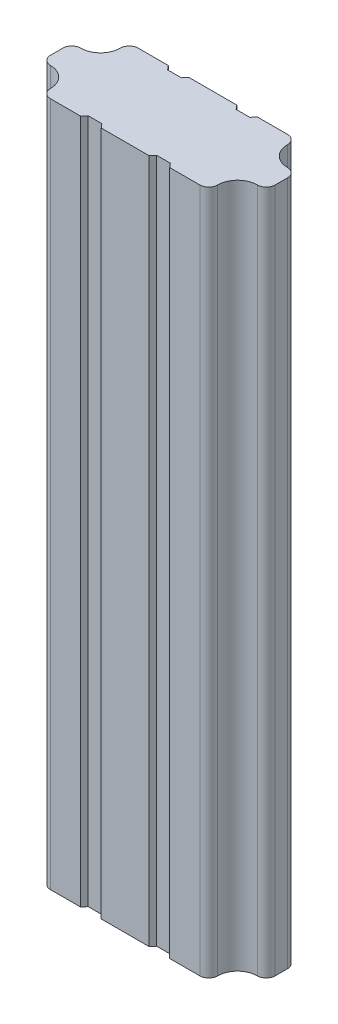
ISO-10303-21;
HEADER;
FILE_DESCRIPTION(('STEP AP214'),'2;1');
FILE_NAME('part.step','',(''),(''),'','','');
FILE_SCHEMA(('AUTOMOTIVE_DESIGN { 1 0 10303 214 1 1 1 1 }'));
ENDSEC;
DATA;
#1=APPLICATION_CONTEXT('core data for automotive mechanical design processes');
#2=APPLICATION_PROTOCOL_DEFINITION('international standard','automotive_design',2000,#1);
#3=PRODUCT_CONTEXT('',#1,'mechanical');
#4=PRODUCT('Part','Part','',(#3));
#5=PRODUCT_RELATED_PRODUCT_CATEGORY('part','',(#4));
#6=PRODUCT_DEFINITION_FORMATION('','',#4);
#7=PRODUCT_DEFINITION_CONTEXT('part definition',#1,'design');
#8=PRODUCT_DEFINITION('design','',#6,#7);
#9=PRODUCT_DEFINITION_SHAPE('','',#8);
#10=(LENGTH_UNIT() NAMED_UNIT(*) SI_UNIT(.MILLI.,.METRE.));
#11=(NAMED_UNIT(*) PLANE_ANGLE_UNIT() SI_UNIT($,.RADIAN.));
#12=(NAMED_UNIT(*) SI_UNIT($,.STERADIAN.) SOLID_ANGLE_UNIT());
#13=UNCERTAINTY_MEASURE_WITH_UNIT(LENGTH_MEASURE(1.E-05),#10,'distance_accuracy_value','');
#14=(GEOMETRIC_REPRESENTATION_CONTEXT(3) GLOBAL_UNCERTAINTY_ASSIGNED_CONTEXT((#13)) GLOBAL_UNIT_ASSIGNED_CONTEXT((#10,
#11,#12)) REPRESENTATION_CONTEXT('',''));
#15=CARTESIAN_POINT('',(0.,0.,0.));
#16=DIRECTION('',(0.,0.,1.));
#17=DIRECTION('',(1.,0.,0.));
#18=AXIS2_PLACEMENT_3D('',#15,#16,#17);
#19=CARTESIAN_POINT('',(-54.5,500.,-25.5));
#20=DIRECTION('',(0.,-1.,0.));
#21=DIRECTION('',(0.,0.,-1.));
#22=AXIS2_PLACEMENT_3D('',#19,#20,#21);
#23=CYLINDRICAL_SURFACE('',#22,6.5);
#24=CARTESIAN_POINT('',(-54.5,0.,-25.5));
#25=DIRECTION('',(0.,1.,0.));
#26=DIRECTION('',(0.,0.,1.));
#27=AXIS2_PLACEMENT_3D('',#24,#25,#26);
#28=CIRCLE('',#27,6.5);
#29=CARTESIAN_POINT('',(-61.,0.,-25.5));
#30=VERTEX_POINT('',#29);
#31=CARTESIAN_POINT('',(-54.5,0.,-32.));
#32=VERTEX_POINT('',#31);
#33=EDGE_CURVE('E281',#30,#32,#28,.F.);
#34=ORIENTED_EDGE('',*,*,#33,.F.);
#35=DIRECTION('',(0.,-1.,0.));
#36=VECTOR('',#35,1.);
#37=CARTESIAN_POINT('',(-61.,500.,-25.5));
#38=LINE('',#37,#36);
#39=CARTESIAN_POINT('',(-61.,500.,-25.5));
#40=VERTEX_POINT('',#39);
#41=EDGE_CURVE('E11',#40,#30,#38,.T.);
#42=ORIENTED_EDGE('',*,*,#41,.F.);
#43=CARTESIAN_POINT('',(-54.5,500.,-25.5));
#44=DIRECTION('',(0.,1.,0.));
#45=DIRECTION('',(0.,0.,1.));
#46=AXIS2_PLACEMENT_3D('',#43,#44,#45);
#47=CIRCLE('',#46,6.5);
#48=CARTESIAN_POINT('',(-54.5,500.,-32.));
#49=VERTEX_POINT('',#48);
#50=EDGE_CURVE('E400',#40,#49,#47,.F.);
#51=ORIENTED_EDGE('',*,*,#50,.T.);
#52=DIRECTION('',(0.,-1.,0.));
#53=VECTOR('',#52,1.);
#54=CARTESIAN_POINT('',(-54.5,500.,-32.));
#55=LINE('',#54,#53);
#56=EDGE_CURVE('E163',#49,#32,#55,.T.);
#57=ORIENTED_EDGE('',*,*,#56,.T.);
#58=EDGE_LOOP('',(#34,#42,#51,#57));
#59=FACE_BOUND('',#58,.T.);
#60=ADVANCED_FACE('F39',(#59),#23,.T.);
#61=CARTESIAN_POINT('',(-75.5,500.,-25.5));
#62=DIRECTION('',(0.,-1.,0.));
#63=DIRECTION('',(0.,0.,-1.));
#64=AXIS2_PLACEMENT_3D('',#61,#62,#63);
#65=CYLINDRICAL_SURFACE('',#64,14.5);
#66=CARTESIAN_POINT('',(-75.5,0.,-25.5));
#67=DIRECTION('',(0.,1.,0.));
#68=DIRECTION('',(0.,0.,1.));
#69=AXIS2_PLACEMENT_3D('',#66,#67,#68);
#70=CIRCLE('',#69,14.5);
#71=CARTESIAN_POINT('',(-75.5,0.,-11.));
#72=VERTEX_POINT('',#71);
#73=EDGE_CURVE('E285',#30,#72,#70,.F.);
#74=ORIENTED_EDGE('',*,*,#73,.T.);
#75=DIRECTION('',(0.,-1.,0.));
#76=VECTOR('',#75,1.);
#77=CARTESIAN_POINT('',(-75.5,500.,-11.));
#78=LINE('',#77,#76);
#79=CARTESIAN_POINT('',(-75.5,500.,-11.));
#80=VERTEX_POINT('',#79);
#81=EDGE_CURVE('E48',#80,#72,#78,.T.);
#82=ORIENTED_EDGE('',*,*,#81,.F.);
#83=CARTESIAN_POINT('',(-75.5,500.,-25.5));
#84=DIRECTION('',(0.,1.,0.));
#85=DIRECTION('',(0.,0.,1.));
#86=AXIS2_PLACEMENT_3D('',#83,#84,#85);
#87=CIRCLE('',#86,14.5);
#88=EDGE_CURVE('E610',#40,#80,#87,.F.);
#89=ORIENTED_EDGE('',*,*,#88,.F.);
#90=ORIENTED_EDGE('',*,*,#41,.T.);
#91=EDGE_LOOP('',(#74,#82,#89,#90));
#92=FACE_BOUND('',#91,.T.);
#93=ADVANCED_FACE('F498',(#92),#65,.F.);
#94=CARTESIAN_POINT('',(-75.5,500.,-4.5));
#95=DIRECTION('',(0.,-1.,0.));
#96=DIRECTION('',(0.,0.,-1.));
#97=AXIS2_PLACEMENT_3D('',#94,#95,#96);
#98=CYLINDRICAL_SURFACE('',#97,6.5);
#99=CARTESIAN_POINT('',(-75.5,0.,-4.5));
#100=DIRECTION('',(0.,1.,0.));
#101=DIRECTION('',(0.,0.,1.));
#102=AXIS2_PLACEMENT_3D('',#99,#100,#101);
#103=CIRCLE('',#102,6.5);
#104=CARTESIAN_POINT('',(-82.,0.,-4.5));
#105=VERTEX_POINT('',#104);
#106=EDGE_CURVE('E289',#105,#72,#103,.F.);
#107=ORIENTED_EDGE('',*,*,#106,.F.);
#108=DIRECTION('',(0.,-1.,0.));
#109=VECTOR('',#108,1.);
#110=CARTESIAN_POINT('',(-82.,500.,-4.5));
#111=LINE('',#110,#109);
#112=CARTESIAN_POINT('',(-82.,500.,-4.5));
#113=VERTEX_POINT('',#112);
#114=EDGE_CURVE('E486',#113,#105,#111,.T.);
#115=ORIENTED_EDGE('',*,*,#114,.F.);
#116=CARTESIAN_POINT('',(-75.5,500.,-4.5));
#117=DIRECTION('',(0.,1.,0.));
#118=DIRECTION('',(0.,0.,1.));
#119=AXIS2_PLACEMENT_3D('',#116,#117,#118);
#120=CIRCLE('',#119,6.5);
#121=EDGE_CURVE('E495',#113,#80,#120,.F.);
#122=ORIENTED_EDGE('',*,*,#121,.T.);
#123=ORIENTED_EDGE('',*,*,#81,.T.);
#124=EDGE_LOOP('',(#107,#115,#122,#123));
#125=FACE_BOUND('',#124,.T.);
#126=ADVANCED_FACE('F493',(#125),#98,.T.);
#127=CARTESIAN_POINT('',(-82.,500.,0.));
#128=DIRECTION('',(1.,0.,0.));
#129=DIRECTION('',(0.,0.,-1.));
#130=AXIS2_PLACEMENT_3D('',#127,#128,#129);
#131=PLANE('',#130);
#132=DIRECTION('',(0.,0.,1.));
#133=VECTOR('',#132,1.);
#134=CARTESIAN_POINT('',(-82.,0.,0.));
#135=LINE('',#134,#133);
#136=CARTESIAN_POINT('',(-82.,0.,4.5));
#137=VERTEX_POINT('',#136);
#138=EDGE_CURVE('E293',#105,#137,#135,.T.);
#139=ORIENTED_EDGE('',*,*,#138,.T.);
#140=DIRECTION('',(0.,-1.,0.));
#141=VECTOR('',#140,1.);
#142=CARTESIAN_POINT('',(-82.,500.,4.5));
#143=LINE('',#142,#141);
#144=CARTESIAN_POINT('',(-82.,500.,4.5));
#145=VERTEX_POINT('',#144);
#146=EDGE_CURVE('E482',#145,#137,#143,.T.);
#147=ORIENTED_EDGE('',*,*,#146,.F.);
#148=DIRECTION('',(0.,0.,1.));
#149=VECTOR('',#148,1.);
#150=CARTESIAN_POINT('',(-82.,500.,0.));
#151=LINE('',#150,#149);
#152=EDGE_CURVE('E516',#113,#145,#151,.T.);
#153=ORIENTED_EDGE('',*,*,#152,.F.);
#154=ORIENTED_EDGE('',*,*,#114,.T.);
#155=EDGE_LOOP('',(#139,#147,#153,#154));
#156=FACE_BOUND('',#155,.T.);
#157=ADVANCED_FACE('F505',(#156),#131,.F.);
#158=CARTESIAN_POINT('',(-75.5,500.,4.5));
#159=DIRECTION('',(0.,-1.,0.));
#160=DIRECTION('',(0.,0.,-1.));
#161=AXIS2_PLACEMENT_3D('',#158,#159,#160);
#162=CYLINDRICAL_SURFACE('',#161,6.5);
#163=CARTESIAN_POINT('',(-75.5,0.,4.5));
#164=DIRECTION('',(0.,1.,0.));
#165=DIRECTION('',(0.,0.,1.));
#166=AXIS2_PLACEMENT_3D('',#163,#164,#165);
#167=CIRCLE('',#166,6.5);
#168=CARTESIAN_POINT('',(-75.5,0.,11.));
#169=VERTEX_POINT('',#168);
#170=EDGE_CURVE('E296',#137,#169,#167,.T.);
#171=ORIENTED_EDGE('',*,*,#170,.T.);
#172=DIRECTION('',(0.,-1.,0.));
#173=VECTOR('',#172,1.);
#174=CARTESIAN_POINT('',(-75.5,500.,11.));
#175=LINE('',#174,#173);
#176=CARTESIAN_POINT('',(-75.5,500.,11.));
#177=VERTEX_POINT('',#176);
#178=EDGE_CURVE('E479',#177,#169,#175,.T.);
#179=ORIENTED_EDGE('',*,*,#178,.F.);
#180=CARTESIAN_POINT('',(-75.5,500.,4.5));
#181=DIRECTION('',(0.,1.,0.));
#182=DIRECTION('',(0.,0.,1.));
#183=AXIS2_PLACEMENT_3D('',#180,#181,#182);
#184=CIRCLE('',#183,6.5);
#185=EDGE_CURVE('E511',#145,#177,#184,.T.);
#186=ORIENTED_EDGE('',*,*,#185,.F.);
#187=ORIENTED_EDGE('',*,*,#146,.T.);
#188=EDGE_LOOP('',(#171,#179,#186,#187));
#189=FACE_BOUND('',#188,.T.);
#190=ADVANCED_FACE('F509',(#189),#162,.T.);
#191=CARTESIAN_POINT('',(-75.5,500.,25.5));
#192=DIRECTION('',(0.,-1.,0.));
#193=DIRECTION('',(0.,0.,-1.));
#194=AXIS2_PLACEMENT_3D('',#191,#192,#193);
#195=CYLINDRICAL_SURFACE('',#194,14.5);
#196=CARTESIAN_POINT('',(-75.5,0.,25.5));
#197=DIRECTION('',(0.,1.,0.));
#198=DIRECTION('',(0.,0.,1.));
#199=AXIS2_PLACEMENT_3D('',#196,#197,#198);
#200=CIRCLE('',#199,14.5);
#201=CARTESIAN_POINT('',(-61.,0.,25.5));
#202=VERTEX_POINT('',#201);
#203=EDGE_CURVE('E300',#202,#169,#200,.T.);
#204=ORIENTED_EDGE('',*,*,#203,.F.);
#205=DIRECTION('',(0.,-1.,0.));
#206=VECTOR('',#205,1.);
#207=CARTESIAN_POINT('',(-61.,500.,25.5));
#208=LINE('',#207,#206);
#209=CARTESIAN_POINT('',(-61.,500.,25.5));
#210=VERTEX_POINT('',#209);
#211=EDGE_CURVE('E476',#210,#202,#208,.T.);
#212=ORIENTED_EDGE('',*,*,#211,.F.);
#213=CARTESIAN_POINT('',(-75.5,500.,25.5));
#214=DIRECTION('',(0.,1.,0.));
#215=DIRECTION('',(0.,0.,1.));
#216=AXIS2_PLACEMENT_3D('',#213,#214,#215);
#217=CIRCLE('',#216,14.5);
#218=EDGE_CURVE('E515',#210,#177,#217,.T.);
#219=ORIENTED_EDGE('',*,*,#218,.T.);
#220=ORIENTED_EDGE('',*,*,#178,.T.);
#221=EDGE_LOOP('',(#204,#212,#219,#220));
#222=FACE_BOUND('',#221,.T.);
#223=ADVANCED_FACE('F628',(#222),#195,.F.);
#224=CARTESIAN_POINT('',(-54.5,500.,25.5));
#225=DIRECTION('',(0.,-1.,0.));
#226=DIRECTION('',(0.,0.,-1.));
#227=AXIS2_PLACEMENT_3D('',#224,#225,#226);
#228=CYLINDRICAL_SURFACE('',#227,6.5);
#229=CARTESIAN_POINT('',(-54.5,0.,25.5));
#230=DIRECTION('',(0.,1.,0.));
#231=DIRECTION('',(0.,0.,1.));
#232=AXIS2_PLACEMENT_3D('',#229,#230,#231);
#233=CIRCLE('',#232,6.5);
#234=CARTESIAN_POINT('',(-54.5,0.,32.));
#235=VERTEX_POINT('',#234);
#236=EDGE_CURVE('E304',#202,#235,#233,.T.);
#237=ORIENTED_EDGE('',*,*,#236,.T.);
#238=DIRECTION('',(0.,-1.,0.));
#239=VECTOR('',#238,1.);
#240=CARTESIAN_POINT('',(-54.5,500.,32.));
#241=LINE('',#240,#239);
#242=CARTESIAN_POINT('',(-54.5,500.,32.));
#243=VERTEX_POINT('',#242);
#244=EDGE_CURVE('E473',#243,#235,#241,.T.);
#245=ORIENTED_EDGE('',*,*,#244,.F.);
#246=CARTESIAN_POINT('',(-54.5,500.,25.5));
#247=DIRECTION('',(0.,1.,0.));
#248=DIRECTION('',(0.,0.,1.));
#249=AXIS2_PLACEMENT_3D('',#246,#247,#248);
#250=CIRCLE('',#249,6.5);
#251=EDGE_CURVE('E520',#210,#243,#250,.T.);
#252=ORIENTED_EDGE('',*,*,#251,.F.);
#253=ORIENTED_EDGE('',*,*,#211,.T.);
#254=EDGE_LOOP('',(#237,#245,#252,#253));
#255=FACE_BOUND('',#254,.T.);
#256=ADVANCED_FACE('F631',(#255),#228,.T.);
#257=CARTESIAN_POINT('',(0.,500.,32.));
#258=DIRECTION('',(0.,0.,1.));
#259=DIRECTION('',(1.,0.,0.));
#260=AXIS2_PLACEMENT_3D('',#257,#258,#259);
#261=PLANE('',#260);
#262=DIRECTION('',(-1.,0.,0.));
#263=VECTOR('',#262,1.);
#264=CARTESIAN_POINT('',(0.,0.,32.));
#265=LINE('',#264,#263);
#266=CARTESIAN_POINT('',(-32.5172988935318,0.,32.));
#267=VERTEX_POINT('',#266);
#268=EDGE_CURVE('E308',#267,#235,#265,.T.);
#269=ORIENTED_EDGE('',*,*,#268,.F.);
#270=DIRECTION('',(0.,-1.,0.));
#271=VECTOR('',#270,1.);
#272=CARTESIAN_POINT('',(-32.5172988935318,500.,32.));
#273=LINE('',#272,#271);
#274=CARTESIAN_POINT('',(-32.5172988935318,500.,32.));
#275=VERTEX_POINT('',#274);
#276=EDGE_CURVE('E470',#275,#267,#273,.T.);
#277=ORIENTED_EDGE('',*,*,#276,.F.);
#278=DIRECTION('',(-1.,0.,0.));
#279=VECTOR('',#278,1.);
#280=CARTESIAN_POINT('',(0.,500.,32.));
#281=LINE('',#280,#279);
#282=EDGE_CURVE('E527',#275,#243,#281,.T.);
#283=ORIENTED_EDGE('',*,*,#282,.T.);
#284=ORIENTED_EDGE('',*,*,#244,.T.);
#285=EDGE_LOOP('',(#269,#277,#283,#284));
#286=FACE_BOUND('',#285,.T.);
#287=ADVANCED_FACE('F635',(#286),#261,.T.);
#288=CARTESIAN_POINT('',(-3.32501024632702,500.,-2.79001487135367));
#289=DIRECTION('',(0.76604444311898,0.,0.642787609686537));
#290=DIRECTION('',(0.642787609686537,0.,-0.76604444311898));
#291=AXIS2_PLACEMENT_3D('',#288,#289,#290);
#292=PLANE('',#291);
#293=DIRECTION('',(-0.642787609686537,0.,0.76604444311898));
#294=VECTOR('',#293,1.);
#295=CARTESIAN_POINT('',(-3.32501024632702,0.,-2.79001487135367));
#296=LINE('',#295,#294);
#297=CARTESIAN_POINT('',(-30.,0.,29.));
#298=VERTEX_POINT('',#297);
#299=EDGE_CURVE('E312',#298,#267,#296,.T.);
#300=ORIENTED_EDGE('',*,*,#299,.F.);
#301=DIRECTION('',(0.,-1.,0.));
#302=VECTOR('',#301,1.);
#303=CARTESIAN_POINT('',(-30.,500.,29.));
#304=LINE('',#303,#302);
#305=CARTESIAN_POINT('',(-30.,500.,29.));
#306=VERTEX_POINT('',#305);
#307=EDGE_CURVE('E467',#306,#298,#304,.T.);
#308=ORIENTED_EDGE('',*,*,#307,.F.);
#309=DIRECTION('',(-0.642787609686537,0.,0.76604444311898));
#310=VECTOR('',#309,1.);
#311=CARTESIAN_POINT('',(-3.32501024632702,500.,-2.79001487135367));
#312=LINE('',#311,#310);
#313=EDGE_CURVE('E531',#306,#275,#312,.T.);
#314=ORIENTED_EDGE('',*,*,#313,.T.);
#315=ORIENTED_EDGE('',*,*,#276,.T.);
#316=EDGE_LOOP('',(#300,#308,#314,#315));
#317=FACE_BOUND('',#316,.T.);
#318=ADVANCED_FACE('F639',(#317),#292,.T.);
#319=CARTESIAN_POINT('',(0.,500.,29.));
#320=DIRECTION('',(0.,0.,1.));
#321=DIRECTION('',(1.,0.,0.));
#322=AXIS2_PLACEMENT_3D('',#319,#320,#321);
#323=PLANE('',#322);
#324=DIRECTION('',(-1.,0.,0.));
#325=VECTOR('',#324,1.);
#326=CARTESIAN_POINT('',(0.,0.,29.));
#327=LINE('',#326,#325);
#328=CARTESIAN_POINT('',(-20.,0.,29.));
#329=VERTEX_POINT('',#328);
#330=EDGE_CURVE('E316',#329,#298,#327,.T.);
#331=ORIENTED_EDGE('',*,*,#330,.F.);
#332=DIRECTION('',(0.,-1.,0.));
#333=VECTOR('',#332,1.);
#334=CARTESIAN_POINT('',(-20.,500.,29.));
#335=LINE('',#334,#333);
#336=CARTESIAN_POINT('',(-20.,500.,29.));
#337=VERTEX_POINT('',#336);
#338=EDGE_CURVE('E464',#337,#329,#335,.T.);
#339=ORIENTED_EDGE('',*,*,#338,.F.);
#340=DIRECTION('',(-1.,0.,0.));
#341=VECTOR('',#340,1.);
#342=CARTESIAN_POINT('',(0.,500.,29.));
#343=LINE('',#342,#341);
#344=EDGE_CURVE('E535',#337,#306,#343,.T.);
#345=ORIENTED_EDGE('',*,*,#344,.T.);
#346=ORIENTED_EDGE('',*,*,#307,.T.);
#347=EDGE_LOOP('',(#331,#339,#345,#346));
#348=FACE_BOUND('',#347,.T.);
#349=ADVANCED_FACE('F643',(#348),#323,.T.);
#350=CARTESIAN_POINT('',(-26.0161941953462,500.,21.8301789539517));
#351=DIRECTION('',(0.766044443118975,0.,-0.642787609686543));
#352=DIRECTION('',(-0.642787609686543,0.,-0.766044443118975));
#353=AXIS2_PLACEMENT_3D('',#350,#351,#352);
#354=PLANE('',#353);
#355=DIRECTION('',(0.642787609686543,0.,0.766044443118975));
#356=VECTOR('',#355,1.);
#357=CARTESIAN_POINT('',(-26.0161941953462,0.,21.8301789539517));
#358=LINE('',#357,#356);
#359=CARTESIAN_POINT('',(-17.4827011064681,0.,32.));
#360=VERTEX_POINT('',#359);
#361=EDGE_CURVE('E320',#329,#360,#358,.T.);
#362=ORIENTED_EDGE('',*,*,#361,.T.);
#363=DIRECTION('',(0.,-1.,0.));
#364=VECTOR('',#363,1.);
#365=CARTESIAN_POINT('',(-17.4827011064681,500.,32.));
#366=LINE('',#365,#364);
#367=CARTESIAN_POINT('',(-17.4827011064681,500.,32.));
#368=VERTEX_POINT('',#367);
#369=EDGE_CURVE('E460',#368,#360,#366,.T.);
#370=ORIENTED_EDGE('',*,*,#369,.F.);
#371=DIRECTION('',(0.642787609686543,0.,0.766044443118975));
#372=VECTOR('',#371,1.);
#373=CARTESIAN_POINT('',(-26.0161941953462,500.,21.8301789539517));
#374=LINE('',#373,#372);
#375=EDGE_CURVE('E539',#337,#368,#374,.T.);
#376=ORIENTED_EDGE('',*,*,#375,.F.);
#377=ORIENTED_EDGE('',*,*,#338,.T.);
#378=EDGE_LOOP('',(#362,#370,#376,#377));
#379=FACE_BOUND('',#378,.T.);
#380=ADVANCED_FACE('F647',(#379),#354,.F.);
#381=CARTESIAN_POINT('',(0.,500.,32.));
#382=DIRECTION('',(0.,0.,-1.));
#383=DIRECTION('',(-1.,0.,0.));
#384=AXIS2_PLACEMENT_3D('',#381,#382,#383);
#385=PLANE('',#384);
#386=DIRECTION('',(1.,0.,0.));
#387=VECTOR('',#386,1.);
#388=CARTESIAN_POINT('',(0.,0.,32.));
#389=LINE('',#388,#387);
#390=CARTESIAN_POINT('',(17.4827011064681,0.,32.));
#391=VERTEX_POINT('',#390);
#392=EDGE_CURVE('E323',#360,#391,#389,.T.);
#393=ORIENTED_EDGE('',*,*,#392,.T.);
#394=DIRECTION('',(0.,-1.,0.));
#395=VECTOR('',#394,1.);
#396=CARTESIAN_POINT('',(17.4827011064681,500.,32.));
#397=LINE('',#396,#395);
#398=CARTESIAN_POINT('',(17.4827011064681,500.,32.));
#399=VERTEX_POINT('',#398);
#400=EDGE_CURVE('E457',#399,#391,#397,.T.);
#401=ORIENTED_EDGE('',*,*,#400,.F.);
#402=DIRECTION('',(1.,0.,0.));
#403=VECTOR('',#402,1.);
#404=CARTESIAN_POINT('',(0.,500.,32.));
#405=LINE('',#404,#403);
#406=EDGE_CURVE('E542',#368,#399,#405,.T.);
#407=ORIENTED_EDGE('',*,*,#406,.F.);
#408=ORIENTED_EDGE('',*,*,#369,.T.);
#409=EDGE_LOOP('',(#393,#401,#407,#408));
#410=FACE_BOUND('',#409,.T.);
#411=ADVANCED_FACE('F651',(#410),#385,.F.);
#412=CARTESIAN_POINT('',(26.0161941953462,500.,21.8301789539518));
#413=DIRECTION('',(0.766044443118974,0.,0.642787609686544));
#414=DIRECTION('',(0.642787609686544,0.,-0.766044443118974));
#415=AXIS2_PLACEMENT_3D('',#412,#413,#414);
#416=PLANE('',#415);
#417=DIRECTION('',(-0.642787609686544,0.,0.766044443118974));
#418=VECTOR('',#417,1.);
#419=CARTESIAN_POINT('',(26.0161941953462,0.,21.8301789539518));
#420=LINE('',#419,#418);
#421=CARTESIAN_POINT('',(20.,0.,29.));
#422=VERTEX_POINT('',#421);
#423=EDGE_CURVE('E327',#422,#391,#420,.T.);
#424=ORIENTED_EDGE('',*,*,#423,.F.);
#425=DIRECTION('',(0.,-1.,0.));
#426=VECTOR('',#425,1.);
#427=CARTESIAN_POINT('',(20.,500.,29.));
#428=LINE('',#427,#426);
#429=CARTESIAN_POINT('',(20.,500.,29.));
#430=VERTEX_POINT('',#429);
#431=EDGE_CURVE('E454',#430,#422,#428,.T.);
#432=ORIENTED_EDGE('',*,*,#431,.F.);
#433=DIRECTION('',(-0.642787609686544,0.,0.766044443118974));
#434=VECTOR('',#433,1.);
#435=CARTESIAN_POINT('',(26.0161941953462,500.,21.8301789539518));
#436=LINE('',#435,#434);
#437=EDGE_CURVE('E545',#430,#399,#436,.T.);
#438=ORIENTED_EDGE('',*,*,#437,.T.);
#439=ORIENTED_EDGE('',*,*,#400,.T.);
#440=EDGE_LOOP('',(#424,#432,#438,#439));
#441=FACE_BOUND('',#440,.T.);
#442=ADVANCED_FACE('F655',(#441),#416,.T.);
#443=CARTESIAN_POINT('',(0.,500.,29.));
#444=DIRECTION('',(0.,0.,-1.));
#445=DIRECTION('',(-1.,0.,0.));
#446=AXIS2_PLACEMENT_3D('',#443,#444,#445);
#447=PLANE('',#446);
#448=DIRECTION('',(1.,0.,0.));
#449=VECTOR('',#448,1.);
#450=CARTESIAN_POINT('',(0.,0.,29.));
#451=LINE('',#450,#449);
#452=CARTESIAN_POINT('',(30.,0.,29.));
#453=VERTEX_POINT('',#452);
#454=EDGE_CURVE('E331',#422,#453,#451,.T.);
#455=ORIENTED_EDGE('',*,*,#454,.T.);
#456=DIRECTION('',(0.,-1.,0.));
#457=VECTOR('',#456,1.);
#458=CARTESIAN_POINT('',(30.,500.,29.));
#459=LINE('',#458,#457);
#460=CARTESIAN_POINT('',(30.,500.,29.));
#461=VERTEX_POINT('',#460);
#462=EDGE_CURVE('E450',#461,#453,#459,.T.);
#463=ORIENTED_EDGE('',*,*,#462,.F.);
#464=DIRECTION('',(1.,0.,0.));
#465=VECTOR('',#464,1.);
#466=CARTESIAN_POINT('',(0.,500.,29.));
#467=LINE('',#466,#465);
#468=EDGE_CURVE('E549',#430,#461,#467,.T.);
#469=ORIENTED_EDGE('',*,*,#468,.F.);
#470=ORIENTED_EDGE('',*,*,#431,.T.);
#471=EDGE_LOOP('',(#455,#463,#469,#470));
#472=FACE_BOUND('',#471,.T.);
#473=ADVANCED_FACE('F659',(#472),#447,.F.);
#474=CARTESIAN_POINT('',(3.325010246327,500.,-2.79001487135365));
#475=DIRECTION('',(0.766044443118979,0.,-0.642787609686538));
#476=DIRECTION('',(-0.642787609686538,0.,-0.766044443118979));
#477=AXIS2_PLACEMENT_3D('',#474,#475,#476);
#478=PLANE('',#477);
#479=DIRECTION('',(0.642787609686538,0.,0.766044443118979));
#480=VECTOR('',#479,1.);
#481=CARTESIAN_POINT('',(3.325010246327,0.,-2.79001487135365));
#482=LINE('',#481,#480);
#483=CARTESIAN_POINT('',(32.5172988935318,0.,32.));
#484=VERTEX_POINT('',#483);
#485=EDGE_CURVE('E334',#453,#484,#482,.T.);
#486=ORIENTED_EDGE('',*,*,#485,.T.);
#487=DIRECTION('',(0.,-1.,0.));
#488=VECTOR('',#487,1.);
#489=CARTESIAN_POINT('',(32.5172988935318,500.,32.));
#490=LINE('',#489,#488);
#491=CARTESIAN_POINT('',(32.5172988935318,500.,32.));
#492=VERTEX_POINT('',#491);
#493=EDGE_CURVE('E446',#492,#484,#490,.T.);
#494=ORIENTED_EDGE('',*,*,#493,.F.);
#495=DIRECTION('',(0.642787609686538,0.,0.766044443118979));
#496=VECTOR('',#495,1.);
#497=CARTESIAN_POINT('',(3.325010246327,500.,-2.79001487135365));
#498=LINE('',#497,#496);
#499=EDGE_CURVE('E552',#461,#492,#498,.T.);
#500=ORIENTED_EDGE('',*,*,#499,.F.);
#501=ORIENTED_EDGE('',*,*,#462,.T.);
#502=EDGE_LOOP('',(#486,#494,#500,#501));
#503=FACE_BOUND('',#502,.T.);
#504=ADVANCED_FACE('F663',(#503),#478,.F.);
#505=CARTESIAN_POINT('',(0.,500.,32.));
#506=DIRECTION('',(0.,0.,-1.));
#507=DIRECTION('',(-1.,0.,0.));
#508=AXIS2_PLACEMENT_3D('',#505,#506,#507);
#509=PLANE('',#508);
#510=DIRECTION('',(1.,0.,0.));
#511=VECTOR('',#510,1.);
#512=CARTESIAN_POINT('',(0.,0.,32.));
#513=LINE('',#512,#511);
#514=CARTESIAN_POINT('',(54.5,0.,32.));
#515=VERTEX_POINT('',#514);
#516=EDGE_CURVE('E337',#484,#515,#513,.T.);
#517=ORIENTED_EDGE('',*,*,#516,.T.);
#518=DIRECTION('',(0.,-1.,0.));
#519=VECTOR('',#518,1.);
#520=CARTESIAN_POINT('',(54.5,500.,32.));
#521=LINE('',#520,#519);
#522=CARTESIAN_POINT('',(54.5,500.,32.));
#523=VERTEX_POINT('',#522);
#524=EDGE_CURVE('E443',#523,#515,#521,.T.);
#525=ORIENTED_EDGE('',*,*,#524,.F.);
#526=DIRECTION('',(1.,0.,0.));
#527=VECTOR('',#526,1.);
#528=CARTESIAN_POINT('',(0.,500.,32.));
#529=LINE('',#528,#527);
#530=EDGE_CURVE('E555',#492,#523,#529,.T.);
#531=ORIENTED_EDGE('',*,*,#530,.F.);
#532=ORIENTED_EDGE('',*,*,#493,.T.);
#533=EDGE_LOOP('',(#517,#525,#531,#532));
#534=FACE_BOUND('',#533,.T.);
#535=ADVANCED_FACE('F667',(#534),#509,.F.);
#536=CARTESIAN_POINT('',(54.5,500.,25.5));
#537=DIRECTION('',(0.,-1.,0.));
#538=DIRECTION('',(0.,0.,-1.));
#539=AXIS2_PLACEMENT_3D('',#536,#537,#538);
#540=CYLINDRICAL_SURFACE('',#539,6.5);
#541=CARTESIAN_POINT('',(54.5,0.,25.5));
#542=DIRECTION('',(0.,1.,0.));
#543=DIRECTION('',(0.,0.,1.));
#544=AXIS2_PLACEMENT_3D('',#541,#542,#543);
#545=CIRCLE('',#544,6.5);
#546=CARTESIAN_POINT('',(61.,0.,25.5));
#547=VERTEX_POINT('',#546);
#548=EDGE_CURVE('E341',#547,#515,#545,.F.);
#549=ORIENTED_EDGE('',*,*,#548,.F.);
#550=DIRECTION('',(0.,-1.,0.));
#551=VECTOR('',#550,1.);
#552=CARTESIAN_POINT('',(61.,500.,25.5));
#553=LINE('',#552,#551);
#554=CARTESIAN_POINT('',(61.,500.,25.5));
#555=VERTEX_POINT('',#554);
#556=EDGE_CURVE('E440',#555,#547,#553,.T.);
#557=ORIENTED_EDGE('',*,*,#556,.F.);
#558=CARTESIAN_POINT('',(54.5,500.,25.5));
#559=DIRECTION('',(0.,1.,0.));
#560=DIRECTION('',(0.,0.,1.));
#561=AXIS2_PLACEMENT_3D('',#558,#559,#560);
#562=CIRCLE('',#561,6.5);
#563=EDGE_CURVE('E558',#555,#523,#562,.F.);
#564=ORIENTED_EDGE('',*,*,#563,.T.);
#565=ORIENTED_EDGE('',*,*,#524,.T.);
#566=EDGE_LOOP('',(#549,#557,#564,#565));
#567=FACE_BOUND('',#566,.T.);
#568=ADVANCED_FACE('F671',(#567),#540,.T.);
#569=CARTESIAN_POINT('',(75.5,500.,25.5));
#570=DIRECTION('',(0.,-1.,0.));
#571=DIRECTION('',(0.,0.,-1.));
#572=AXIS2_PLACEMENT_3D('',#569,#570,#571);
#573=CYLINDRICAL_SURFACE('',#572,14.5);
#574=CARTESIAN_POINT('',(75.5,0.,25.5));
#575=DIRECTION('',(0.,1.,0.));
#576=DIRECTION('',(0.,0.,1.));
#577=AXIS2_PLACEMENT_3D('',#574,#575,#576);
#578=CIRCLE('',#577,14.5);
#579=CARTESIAN_POINT('',(75.5,0.,11.));
#580=VERTEX_POINT('',#579);
#581=EDGE_CURVE('E345',#547,#580,#578,.F.);
#582=ORIENTED_EDGE('',*,*,#581,.T.);
#583=DIRECTION('',(0.,-1.,0.));
#584=VECTOR('',#583,1.);
#585=CARTESIAN_POINT('',(75.5,500.,11.));
#586=LINE('',#585,#584);
#587=CARTESIAN_POINT('',(75.5,500.,11.));
#588=VERTEX_POINT('',#587);
#589=EDGE_CURVE('E437',#588,#580,#586,.T.);
#590=ORIENTED_EDGE('',*,*,#589,.F.);
#591=CARTESIAN_POINT('',(75.5,500.,25.5));
#592=DIRECTION('',(0.,1.,0.));
#593=DIRECTION('',(0.,0.,1.));
#594=AXIS2_PLACEMENT_3D('',#591,#592,#593);
#595=CIRCLE('',#594,14.5);
#596=EDGE_CURVE('E562',#555,#588,#595,.F.);
#597=ORIENTED_EDGE('',*,*,#596,.F.);
#598=ORIENTED_EDGE('',*,*,#556,.T.);
#599=EDGE_LOOP('',(#582,#590,#597,#598));
#600=FACE_BOUND('',#599,.T.);
#601=ADVANCED_FACE('F675',(#600),#573,.F.);
#602=CARTESIAN_POINT('',(75.5,500.,4.5));
#603=DIRECTION('',(0.,-1.,0.));
#604=DIRECTION('',(0.,0.,-1.));
#605=AXIS2_PLACEMENT_3D('',#602,#603,#604);
#606=CYLINDRICAL_SURFACE('',#605,6.5);
#607=CARTESIAN_POINT('',(75.5,0.,4.5));
#608=DIRECTION('',(0.,1.,0.));
#609=DIRECTION('',(0.,0.,1.));
#610=AXIS2_PLACEMENT_3D('',#607,#608,#609);
#611=CIRCLE('',#610,6.5);
#612=CARTESIAN_POINT('',(82.,0.,4.5));
#613=VERTEX_POINT('',#612);
#614=EDGE_CURVE('E349',#613,#580,#611,.F.);
#615=ORIENTED_EDGE('',*,*,#614,.F.);
#616=DIRECTION('',(0.,-1.,0.));
#617=VECTOR('',#616,1.);
#618=CARTESIAN_POINT('',(82.,500.,4.5));
#619=LINE('',#618,#617);
#620=CARTESIAN_POINT('',(82.,500.,4.5));
#621=VERTEX_POINT('',#620);
#622=EDGE_CURVE('E434',#621,#613,#619,.T.);
#623=ORIENTED_EDGE('',*,*,#622,.F.);
#624=CARTESIAN_POINT('',(75.5,500.,4.5));
#625=DIRECTION('',(0.,1.,0.));
#626=DIRECTION('',(0.,0.,1.));
#627=AXIS2_PLACEMENT_3D('',#624,#625,#626);
#628=CIRCLE('',#627,6.5);
#629=EDGE_CURVE('E565',#621,#588,#628,.F.);
#630=ORIENTED_EDGE('',*,*,#629,.T.);
#631=ORIENTED_EDGE('',*,*,#589,.T.);
#632=EDGE_LOOP('',(#615,#623,#630,#631));
#633=FACE_BOUND('',#632,.T.);
#634=ADVANCED_FACE('F679',(#633),#606,.T.);
#635=CARTESIAN_POINT('',(82.,500.,0.));
#636=DIRECTION('',(1.,0.,0.));
#637=DIRECTION('',(0.,0.,-1.));
#638=AXIS2_PLACEMENT_3D('',#635,#636,#637);
#639=PLANE('',#638);
#640=DIRECTION('',(0.,0.,1.));
#641=VECTOR('',#640,1.);
#642=CARTESIAN_POINT('',(82.,0.,0.));
#643=LINE('',#642,#641);
#644=CARTESIAN_POINT('',(82.,0.,-4.5));
#645=VERTEX_POINT('',#644);
#646=EDGE_CURVE('E353',#645,#613,#643,.T.);
#647=ORIENTED_EDGE('',*,*,#646,.F.);
#648=DIRECTION('',(0.,-1.,0.));
#649=VECTOR('',#648,1.);
#650=CARTESIAN_POINT('',(82.,500.,-4.5));
#651=LINE('',#650,#649);
#652=CARTESIAN_POINT('',(82.,500.,-4.5));
#653=VERTEX_POINT('',#652);
#654=EDGE_CURVE('E431',#653,#645,#651,.T.);
#655=ORIENTED_EDGE('',*,*,#654,.F.);
#656=DIRECTION('',(0.,0.,1.));
#657=VECTOR('',#656,1.);
#658=CARTESIAN_POINT('',(82.,500.,0.));
#659=LINE('',#658,#657);
#660=EDGE_CURVE('E569',#653,#621,#659,.T.);
#661=ORIENTED_EDGE('',*,*,#660,.T.);
#662=ORIENTED_EDGE('',*,*,#622,.T.);
#663=EDGE_LOOP('',(#647,#655,#661,#662));
#664=FACE_BOUND('',#663,.T.);
#665=ADVANCED_FACE('F683',(#664),#639,.T.);
#666=CARTESIAN_POINT('',(75.5,500.,-4.5));
#667=DIRECTION('',(0.,-1.,0.));
#668=DIRECTION('',(0.,0.,-1.));
#669=AXIS2_PLACEMENT_3D('',#666,#667,#668);
#670=CYLINDRICAL_SURFACE('',#669,6.5);
#671=CARTESIAN_POINT('',(75.5,0.,-4.5));
#672=DIRECTION('',(0.,1.,0.));
#673=DIRECTION('',(0.,0.,1.));
#674=AXIS2_PLACEMENT_3D('',#671,#672,#673);
#675=CIRCLE('',#674,6.5);
#676=CARTESIAN_POINT('',(75.5,0.,-11.));
#677=VERTEX_POINT('',#676);
#678=EDGE_CURVE('E357',#645,#677,#675,.T.);
#679=ORIENTED_EDGE('',*,*,#678,.T.);
#680=DIRECTION('',(0.,-1.,0.));
#681=VECTOR('',#680,1.);
#682=CARTESIAN_POINT('',(75.5,500.,-11.));
#683=LINE('',#682,#681);
#684=CARTESIAN_POINT('',(75.5,500.,-11.));
#685=VERTEX_POINT('',#684);
#686=EDGE_CURVE('E428',#685,#677,#683,.T.);
#687=ORIENTED_EDGE('',*,*,#686,.F.);
#688=CARTESIAN_POINT('',(75.5,500.,-4.5));
#689=DIRECTION('',(0.,1.,0.));
#690=DIRECTION('',(0.,0.,1.));
#691=AXIS2_PLACEMENT_3D('',#688,#689,#690);
#692=CIRCLE('',#691,6.5);
#693=EDGE_CURVE('E573',#653,#685,#692,.T.);
#694=ORIENTED_EDGE('',*,*,#693,.F.);
#695=ORIENTED_EDGE('',*,*,#654,.T.);
#696=EDGE_LOOP('',(#679,#687,#694,#695));
#697=FACE_BOUND('',#696,.T.);
#698=ADVANCED_FACE('F687',(#697),#670,.T.);
#699=CARTESIAN_POINT('',(75.5,500.,-25.5));
#700=DIRECTION('',(0.,-1.,0.));
#701=DIRECTION('',(0.,0.,-1.));
#702=AXIS2_PLACEMENT_3D('',#699,#700,#701);
#703=CYLINDRICAL_SURFACE('',#702,14.5);
#704=CARTESIAN_POINT('',(75.5,0.,-25.5));
#705=DIRECTION('',(0.,1.,0.));
#706=DIRECTION('',(0.,0.,1.));
#707=AXIS2_PLACEMENT_3D('',#704,#705,#706);
#708=CIRCLE('',#707,14.5);
#709=CARTESIAN_POINT('',(61.,0.,-25.5));
#710=VERTEX_POINT('',#709);
#711=EDGE_CURVE('E361',#710,#677,#708,.T.);
#712=ORIENTED_EDGE('',*,*,#711,.F.);
#713=DIRECTION('',(0.,-1.,0.));
#714=VECTOR('',#713,1.);
#715=CARTESIAN_POINT('',(61.,500.,-25.5));
#716=LINE('',#715,#714);
#717=CARTESIAN_POINT('',(61.,500.,-25.5));
#718=VERTEX_POINT('',#717);
#719=EDGE_CURVE('E425',#718,#710,#716,.T.);
#720=ORIENTED_EDGE('',*,*,#719,.F.);
#721=CARTESIAN_POINT('',(75.5,500.,-25.5));
#722=DIRECTION('',(0.,1.,0.));
#723=DIRECTION('',(0.,0.,1.));
#724=AXIS2_PLACEMENT_3D('',#721,#722,#723);
#725=CIRCLE('',#724,14.5);
#726=EDGE_CURVE('E576',#718,#685,#725,.T.);
#727=ORIENTED_EDGE('',*,*,#726,.T.);
#728=ORIENTED_EDGE('',*,*,#686,.T.);
#729=EDGE_LOOP('',(#712,#720,#727,#728));
#730=FACE_BOUND('',#729,.T.);
#731=ADVANCED_FACE('F691',(#730),#703,.F.);
#732=CARTESIAN_POINT('',(54.5,500.,-25.5));
#733=DIRECTION('',(0.,-1.,0.));
#734=DIRECTION('',(0.,0.,-1.));
#735=AXIS2_PLACEMENT_3D('',#732,#733,#734);
#736=CYLINDRICAL_SURFACE('',#735,6.5);
#737=CARTESIAN_POINT('',(54.5,0.,-25.5));
#738=DIRECTION('',(0.,1.,0.));
#739=DIRECTION('',(0.,0.,1.));
#740=AXIS2_PLACEMENT_3D('',#737,#738,#739);
#741=CIRCLE('',#740,6.5);
#742=CARTESIAN_POINT('',(54.5,0.,-32.));
#743=VERTEX_POINT('',#742);
#744=EDGE_CURVE('E365',#710,#743,#741,.T.);
#745=ORIENTED_EDGE('',*,*,#744,.T.);
#746=DIRECTION('',(0.,-1.,0.));
#747=VECTOR('',#746,1.);
#748=CARTESIAN_POINT('',(54.5,500.,-32.));
#749=LINE('',#748,#747);
#750=CARTESIAN_POINT('',(54.5,500.,-32.));
#751=VERTEX_POINT('',#750);
#752=EDGE_CURVE('E422',#751,#743,#749,.T.);
#753=ORIENTED_EDGE('',*,*,#752,.F.);
#754=CARTESIAN_POINT('',(54.5,500.,-25.5));
#755=DIRECTION('',(0.,1.,0.));
#756=DIRECTION('',(0.,0.,1.));
#757=AXIS2_PLACEMENT_3D('',#754,#755,#756);
#758=CIRCLE('',#757,6.5);
#759=EDGE_CURVE('E580',#718,#751,#758,.T.);
#760=ORIENTED_EDGE('',*,*,#759,.F.);
#761=ORIENTED_EDGE('',*,*,#719,.T.);
#762=EDGE_LOOP('',(#745,#753,#760,#761));
#763=FACE_BOUND('',#762,.T.);
#764=ADVANCED_FACE('F695',(#763),#736,.T.);
#765=CARTESIAN_POINT('',(0.,500.,-32.));
#766=DIRECTION('',(0.,0.,-1.));
#767=DIRECTION('',(-1.,0.,0.));
#768=AXIS2_PLACEMENT_3D('',#765,#766,#767);
#769=PLANE('',#768);
#770=DIRECTION('',(1.,0.,0.));
#771=VECTOR('',#770,1.);
#772=CARTESIAN_POINT('',(0.,0.,-32.));
#773=LINE('',#772,#771);
#774=CARTESIAN_POINT('',(32.5172988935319,0.,-32.));
#775=VERTEX_POINT('',#774);
#776=EDGE_CURVE('E369',#775,#743,#773,.T.);
#777=ORIENTED_EDGE('',*,*,#776,.F.);
#778=DIRECTION('',(0.,-1.,0.));
#779=VECTOR('',#778,1.);
#780=CARTESIAN_POINT('',(32.5172988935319,500.,-32.));
#781=LINE('',#780,#779);
#782=CARTESIAN_POINT('',(32.5172988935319,500.,-32.));
#783=VERTEX_POINT('',#782);
#784=EDGE_CURVE('E419',#783,#775,#781,.T.);
#785=ORIENTED_EDGE('',*,*,#784,.F.);
#786=DIRECTION('',(1.,0.,0.));
#787=VECTOR('',#786,1.);
#788=CARTESIAN_POINT('',(0.,500.,-32.));
#789=LINE('',#788,#787);
#790=EDGE_CURVE('E583',#783,#751,#789,.T.);
#791=ORIENTED_EDGE('',*,*,#790,.T.);
#792=ORIENTED_EDGE('',*,*,#752,.T.);
#793=EDGE_LOOP('',(#777,#785,#791,#792));
#794=FACE_BOUND('',#793,.T.);
#795=ADVANCED_FACE('F699',(#794),#769,.T.);
#796=CARTESIAN_POINT('',(3.325010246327,500.,2.79001487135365));
#797=DIRECTION('',(-0.766044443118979,0.,-0.642787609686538));
#798=DIRECTION('',(-0.642787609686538,0.,0.766044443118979));
#799=AXIS2_PLACEMENT_3D('',#796,#797,#798);
#800=PLANE('',#799);
#801=DIRECTION('',(0.642787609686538,0.,-0.766044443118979));
#802=VECTOR('',#801,1.);
#803=CARTESIAN_POINT('',(3.325010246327,0.,2.79001487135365));
#804=LINE('',#803,#802);
#805=CARTESIAN_POINT('',(30.,0.,-29.));
#806=VERTEX_POINT('',#805);
#807=EDGE_CURVE('E373',#806,#775,#804,.T.);
#808=ORIENTED_EDGE('',*,*,#807,.F.);
#809=DIRECTION('',(0.,-1.,0.));
#810=VECTOR('',#809,1.);
#811=CARTESIAN_POINT('',(30.,500.,-29.));
#812=LINE('',#811,#810);
#813=CARTESIAN_POINT('',(30.,500.,-29.));
#814=VERTEX_POINT('',#813);
#815=EDGE_CURVE('E416',#814,#806,#812,.T.);
#816=ORIENTED_EDGE('',*,*,#815,.F.);
#817=DIRECTION('',(0.642787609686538,0.,-0.766044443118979));
#818=VECTOR('',#817,1.);
#819=CARTESIAN_POINT('',(3.325010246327,500.,2.79001487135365));
#820=LINE('',#819,#818);
#821=EDGE_CURVE('E587',#814,#783,#820,.T.);
#822=ORIENTED_EDGE('',*,*,#821,.T.);
#823=ORIENTED_EDGE('',*,*,#784,.T.);
#824=EDGE_LOOP('',(#808,#816,#822,#823));
#825=FACE_BOUND('',#824,.T.);
#826=ADVANCED_FACE('F703',(#825),#800,.T.);
#827=CARTESIAN_POINT('',(0.,500.,-29.));
#828=DIRECTION('',(0.,0.,-1.));
#829=DIRECTION('',(-1.,0.,0.));
#830=AXIS2_PLACEMENT_3D('',#827,#828,#829);
#831=PLANE('',#830);
#832=DIRECTION('',(1.,0.,0.));
#833=VECTOR('',#832,1.);
#834=CARTESIAN_POINT('',(0.,0.,-29.));
#835=LINE('',#834,#833);
#836=CARTESIAN_POINT('',(20.,0.,-29.));
#837=VERTEX_POINT('',#836);
#838=EDGE_CURVE('E377',#837,#806,#835,.T.);
#839=ORIENTED_EDGE('',*,*,#838,.F.);
#840=DIRECTION('',(0.,-1.,0.));
#841=VECTOR('',#840,1.);
#842=CARTESIAN_POINT('',(20.,500.,-29.));
#843=LINE('',#842,#841);
#844=CARTESIAN_POINT('',(20.,500.,-29.));
#845=VERTEX_POINT('',#844);
#846=EDGE_CURVE('E413',#845,#837,#843,.T.);
#847=ORIENTED_EDGE('',*,*,#846,.F.);
#848=DIRECTION('',(1.,0.,0.));
#849=VECTOR('',#848,1.);
#850=CARTESIAN_POINT('',(0.,500.,-29.));
#851=LINE('',#850,#849);
#852=EDGE_CURVE('E591',#845,#814,#851,.T.);
#853=ORIENTED_EDGE('',*,*,#852,.T.);
#854=ORIENTED_EDGE('',*,*,#815,.T.);
#855=EDGE_LOOP('',(#839,#847,#853,#854));
#856=FACE_BOUND('',#855,.T.);
#857=ADVANCED_FACE('F707',(#856),#831,.T.);
#858=CARTESIAN_POINT('',(26.0161941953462,500.,-21.8301789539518));
#859=DIRECTION('',(-0.766044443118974,0.,0.642787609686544));
#860=DIRECTION('',(0.642787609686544,0.,0.766044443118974));
#861=AXIS2_PLACEMENT_3D('',#858,#859,#860);
#862=PLANE('',#861);
#863=DIRECTION('',(-0.642787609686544,0.,-0.766044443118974));
#864=VECTOR('',#863,1.);
#865=CARTESIAN_POINT('',(26.0161941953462,0.,-21.8301789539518));
#866=LINE('',#865,#864);
#867=CARTESIAN_POINT('',(17.4827011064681,0.,-32.));
#868=VERTEX_POINT('',#867);
#869=EDGE_CURVE('E381',#837,#868,#866,.T.);
#870=ORIENTED_EDGE('',*,*,#869,.T.);
#871=DIRECTION('',(0.,-1.,0.));
#872=VECTOR('',#871,1.);
#873=CARTESIAN_POINT('',(17.4827011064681,500.,-32.));
#874=LINE('',#873,#872);
#875=CARTESIAN_POINT('',(17.4827011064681,500.,-32.));
#876=VERTEX_POINT('',#875);
#877=EDGE_CURVE('E410',#876,#868,#874,.T.);
#878=ORIENTED_EDGE('',*,*,#877,.F.);
#879=DIRECTION('',(-0.642787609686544,0.,-0.766044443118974));
#880=VECTOR('',#879,1.);
#881=CARTESIAN_POINT('',(26.0161941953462,500.,-21.8301789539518));
#882=LINE('',#881,#880);
#883=EDGE_CURVE('E595',#845,#876,#882,.T.);
#884=ORIENTED_EDGE('',*,*,#883,.F.);
#885=ORIENTED_EDGE('',*,*,#846,.T.);
#886=EDGE_LOOP('',(#870,#878,#884,#885));
#887=FACE_BOUND('',#886,.T.);
#888=ADVANCED_FACE('F711',(#887),#862,.F.);
#889=CARTESIAN_POINT('',(0.,500.,-32.));
#890=DIRECTION('',(0.,0.,-1.));
#891=DIRECTION('',(-1.,0.,0.));
#892=AXIS2_PLACEMENT_3D('',#889,#890,#891);
#893=PLANE('',#892);
#894=DIRECTION('',(1.,0.,0.));
#895=VECTOR('',#894,1.);
#896=CARTESIAN_POINT('',(0.,0.,-32.));
#897=LINE('',#896,#895);
#898=CARTESIAN_POINT('',(-17.4827011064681,0.,-32.));
#899=VERTEX_POINT('',#898);
#900=EDGE_CURVE('E385',#899,#868,#897,.T.);
#901=ORIENTED_EDGE('',*,*,#900,.F.);
#902=DIRECTION('',(0.,-1.,0.));
#903=VECTOR('',#902,1.);
#904=CARTESIAN_POINT('',(-17.4827011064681,500.,-32.));
#905=LINE('',#904,#903);
#906=CARTESIAN_POINT('',(-17.4827011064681,500.,-32.));
#907=VERTEX_POINT('',#906);
#908=EDGE_CURVE('E407',#907,#899,#905,.T.);
#909=ORIENTED_EDGE('',*,*,#908,.F.);
#910=DIRECTION('',(1.,0.,0.));
#911=VECTOR('',#910,1.);
#912=CARTESIAN_POINT('',(0.,500.,-32.));
#913=LINE('',#912,#911);
#914=EDGE_CURVE('E598',#907,#876,#913,.T.);
#915=ORIENTED_EDGE('',*,*,#914,.T.);
#916=ORIENTED_EDGE('',*,*,#877,.T.);
#917=EDGE_LOOP('',(#901,#909,#915,#916));
#918=FACE_BOUND('',#917,.T.);
#919=ADVANCED_FACE('F715',(#918),#893,.T.);
#920=CARTESIAN_POINT('',(-26.0161941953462,500.,-21.8301789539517));
#921=DIRECTION('',(-0.766044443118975,0.,-0.642787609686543));
#922=DIRECTION('',(-0.642787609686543,0.,0.766044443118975));
#923=AXIS2_PLACEMENT_3D('',#920,#921,#922);
#924=PLANE('',#923);
#925=DIRECTION('',(0.642787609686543,0.,-0.766044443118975));
#926=VECTOR('',#925,1.);
#927=CARTESIAN_POINT('',(-26.0161941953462,0.,-21.8301789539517));
#928=LINE('',#927,#926);
#929=CARTESIAN_POINT('',(-20.,0.,-29.));
#930=VERTEX_POINT('',#929);
#931=EDGE_CURVE('E389',#930,#899,#928,.T.);
#932=ORIENTED_EDGE('',*,*,#931,.F.);
#933=DIRECTION('',(0.,-1.,0.));
#934=VECTOR('',#933,1.);
#935=CARTESIAN_POINT('',(-20.,500.,-29.));
#936=LINE('',#935,#934);
#937=CARTESIAN_POINT('',(-20.,500.,-29.));
#938=VERTEX_POINT('',#937);
#939=EDGE_CURVE('E271',#938,#930,#936,.T.);
#940=ORIENTED_EDGE('',*,*,#939,.F.);
#941=DIRECTION('',(0.642787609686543,0.,-0.766044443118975));
#942=VECTOR('',#941,1.);
#943=CARTESIAN_POINT('',(-26.0161941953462,500.,-21.8301789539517));
#944=LINE('',#943,#942);
#945=EDGE_CURVE('E262',#938,#907,#944,.T.);
#946=ORIENTED_EDGE('',*,*,#945,.T.);
#947=ORIENTED_EDGE('',*,*,#908,.T.);
#948=EDGE_LOOP('',(#932,#940,#946,#947));
#949=FACE_BOUND('',#948,.T.);
#950=ADVANCED_FACE('F604',(#949),#924,.T.);
#951=CARTESIAN_POINT('',(0.,500.,-29.));
#952=DIRECTION('',(0.,0.,1.));
#953=DIRECTION('',(1.,0.,0.));
#954=AXIS2_PLACEMENT_3D('',#951,#952,#953);
#955=PLANE('',#954);
#956=DIRECTION('',(-1.,0.,0.));
#957=VECTOR('',#956,1.);
#958=CARTESIAN_POINT('',(0.,0.,-29.));
#959=LINE('',#958,#957);
#960=CARTESIAN_POINT('',(-30.,0.,-29.));
#961=VERTEX_POINT('',#960);
#962=EDGE_CURVE('E269',#930,#961,#959,.T.);
#963=ORIENTED_EDGE('',*,*,#962,.T.);
#964=DIRECTION('',(0.,-1.,0.));
#965=VECTOR('',#964,1.);
#966=CARTESIAN_POINT('',(-30.,500.,-29.));
#967=LINE('',#966,#965);
#968=CARTESIAN_POINT('',(-30.,500.,-29.));
#969=VERTEX_POINT('',#968);
#970=EDGE_CURVE('E266',#969,#961,#967,.T.);
#971=ORIENTED_EDGE('',*,*,#970,.F.);
#972=DIRECTION('',(-1.,0.,0.));
#973=VECTOR('',#972,1.);
#974=CARTESIAN_POINT('',(0.,500.,-29.));
#975=LINE('',#974,#973);
#976=EDGE_CURVE('E255',#938,#969,#975,.T.);
#977=ORIENTED_EDGE('',*,*,#976,.F.);
#978=ORIENTED_EDGE('',*,*,#939,.T.);
#979=EDGE_LOOP('',(#963,#971,#977,#978));
#980=FACE_BOUND('',#979,.T.);
#981=ADVANCED_FACE('F267',(#980),#955,.F.);
#982=CARTESIAN_POINT('',(-3.32501024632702,500.,2.79001487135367));
#983=DIRECTION('',(-0.76604444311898,0.,0.642787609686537));
#984=DIRECTION('',(0.642787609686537,0.,0.76604444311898));
#985=AXIS2_PLACEMENT_3D('',#982,#983,#984);
#986=PLANE('',#985);
#987=DIRECTION('',(-0.642787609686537,0.,-0.76604444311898));
#988=VECTOR('',#987,1.);
#989=CARTESIAN_POINT('',(-3.32501024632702,0.,2.79001487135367));
#990=LINE('',#989,#988);
#991=CARTESIAN_POINT('',(-32.5172988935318,0.,-32.));
#992=VERTEX_POINT('',#991);
#993=EDGE_CURVE('E156',#961,#992,#990,.T.);
#994=ORIENTED_EDGE('',*,*,#993,.T.);
#995=DIRECTION('',(0.,-1.,0.));
#996=VECTOR('',#995,1.);
#997=CARTESIAN_POINT('',(-32.5172988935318,500.,-32.));
#998=LINE('',#997,#996);
#999=CARTESIAN_POINT('',(-32.5172988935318,500.,-32.));
#1000=VERTEX_POINT('',#999);
#1001=EDGE_CURVE('E272',#1000,#992,#998,.T.);
#1002=ORIENTED_EDGE('',*,*,#1001,.F.);
#1003=DIRECTION('',(-0.642787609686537,0.,-0.76604444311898));
#1004=VECTOR('',#1003,1.);
#1005=CARTESIAN_POINT('',(-3.32501024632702,500.,2.79001487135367));
#1006=LINE('',#1005,#1004);
#1007=EDGE_CURVE('E259',#969,#1000,#1006,.T.);
#1008=ORIENTED_EDGE('',*,*,#1007,.F.);
#1009=ORIENTED_EDGE('',*,*,#970,.T.);
#1010=EDGE_LOOP('',(#994,#1002,#1008,#1009));
#1011=FACE_BOUND('',#1010,.T.);
#1012=ADVANCED_FACE('F274',(#1011),#986,.F.);
#1013=CARTESIAN_POINT('',(0.,500.,-32.));
#1014=DIRECTION('',(0.,0.,1.));
#1015=DIRECTION('',(1.,0.,0.));
#1016=AXIS2_PLACEMENT_3D('',#1013,#1014,#1015);
#1017=PLANE('',#1016);
#1018=DIRECTION('',(-1.,0.,0.));
#1019=VECTOR('',#1018,1.);
#1020=CARTESIAN_POINT('',(0.,0.,-32.));
#1021=LINE('',#1020,#1019);
#1022=EDGE_CURVE('E397',#992,#32,#1021,.T.);
#1023=ORIENTED_EDGE('',*,*,#1022,.T.);
#1024=ORIENTED_EDGE('',*,*,#56,.F.);
#1025=DIRECTION('',(-1.,0.,0.));
#1026=VECTOR('',#1025,1.);
#1027=CARTESIAN_POINT('',(0.,500.,-32.));
#1028=LINE('',#1027,#1026);
#1029=EDGE_CURVE('E56',#1000,#49,#1028,.T.);
#1030=ORIENTED_EDGE('',*,*,#1029,.F.);
#1031=ORIENTED_EDGE('',*,*,#1001,.T.);
#1032=EDGE_LOOP('',(#1023,#1024,#1030,#1031));
#1033=FACE_BOUND('',#1032,.T.);
#1034=ADVANCED_FACE('F608',(#1033),#1017,.F.);
#1035=CARTESIAN_POINT('',(0.,500.,0.));
#1036=DIRECTION('',(0.,1.,0.));
#1037=DIRECTION('',(0.,0.,1.));
#1038=AXIS2_PLACEMENT_3D('',#1035,#1036,#1037);
#1039=PLANE('',#1038);
#1040=ORIENTED_EDGE('',*,*,#50,.F.);
#1041=ORIENTED_EDGE('',*,*,#88,.T.);
#1042=ORIENTED_EDGE('',*,*,#121,.F.);
#1043=ORIENTED_EDGE('',*,*,#152,.T.);
#1044=ORIENTED_EDGE('',*,*,#185,.T.);
#1045=ORIENTED_EDGE('',*,*,#218,.F.);
#1046=ORIENTED_EDGE('',*,*,#251,.T.);
#1047=ORIENTED_EDGE('',*,*,#282,.F.);
#1048=ORIENTED_EDGE('',*,*,#313,.F.);
#1049=ORIENTED_EDGE('',*,*,#344,.F.);
#1050=ORIENTED_EDGE('',*,*,#375,.T.);
#1051=ORIENTED_EDGE('',*,*,#406,.T.);
#1052=ORIENTED_EDGE('',*,*,#437,.F.);
#1053=ORIENTED_EDGE('',*,*,#468,.T.);
#1054=ORIENTED_EDGE('',*,*,#499,.T.);
#1055=ORIENTED_EDGE('',*,*,#530,.T.);
#1056=ORIENTED_EDGE('',*,*,#563,.F.);
#1057=ORIENTED_EDGE('',*,*,#596,.T.);
#1058=ORIENTED_EDGE('',*,*,#629,.F.);
#1059=ORIENTED_EDGE('',*,*,#660,.F.);
#1060=ORIENTED_EDGE('',*,*,#693,.T.);
#1061=ORIENTED_EDGE('',*,*,#726,.F.);
#1062=ORIENTED_EDGE('',*,*,#759,.T.);
#1063=ORIENTED_EDGE('',*,*,#790,.F.);
#1064=ORIENTED_EDGE('',*,*,#821,.F.);
#1065=ORIENTED_EDGE('',*,*,#852,.F.);
#1066=ORIENTED_EDGE('',*,*,#883,.T.);
#1067=ORIENTED_EDGE('',*,*,#914,.F.);
#1068=ORIENTED_EDGE('',*,*,#945,.F.);
#1069=ORIENTED_EDGE('',*,*,#976,.T.);
#1070=ORIENTED_EDGE('',*,*,#1007,.T.);
#1071=ORIENTED_EDGE('',*,*,#1029,.T.);
#1072=EDGE_LOOP('',(#1040,#1041,#1042,#1043,#1044,#1045,#1046,#1047,#1048,#1049,#1050,#1051,
#1052,#1053,#1054,#1055,#1056,#1057,#1058,#1059,#1060,#1061,#1062,#1063,#1064,#1065,#1066,#1067,
#1068,#1069,#1070,#1071));
#1073=FACE_BOUND('',#1072,.T.);
#1074=ADVANCED_FACE('F257',(#1073),#1039,.T.);
#1075=CARTESIAN_POINT('',(0.,0.,0.));
#1076=DIRECTION('',(0.,1.,0.));
#1077=DIRECTION('',(0.,0.,1.));
#1078=AXIS2_PLACEMENT_3D('',#1075,#1076,#1077);
#1079=PLANE('',#1078);
#1080=ORIENTED_EDGE('',*,*,#33,.T.);
#1081=ORIENTED_EDGE('',*,*,#1022,.F.);
#1082=ORIENTED_EDGE('',*,*,#993,.F.);
#1083=ORIENTED_EDGE('',*,*,#962,.F.);
#1084=ORIENTED_EDGE('',*,*,#931,.T.);
#1085=ORIENTED_EDGE('',*,*,#900,.T.);
#1086=ORIENTED_EDGE('',*,*,#869,.F.);
#1087=ORIENTED_EDGE('',*,*,#838,.T.);
#1088=ORIENTED_EDGE('',*,*,#807,.T.);
#1089=ORIENTED_EDGE('',*,*,#776,.T.);
#1090=ORIENTED_EDGE('',*,*,#744,.F.);
#1091=ORIENTED_EDGE('',*,*,#711,.T.);
#1092=ORIENTED_EDGE('',*,*,#678,.F.);
#1093=ORIENTED_EDGE('',*,*,#646,.T.);
#1094=ORIENTED_EDGE('',*,*,#614,.T.);
#1095=ORIENTED_EDGE('',*,*,#581,.F.);
#1096=ORIENTED_EDGE('',*,*,#548,.T.);
#1097=ORIENTED_EDGE('',*,*,#516,.F.);
#1098=ORIENTED_EDGE('',*,*,#485,.F.);
#1099=ORIENTED_EDGE('',*,*,#454,.F.);
#1100=ORIENTED_EDGE('',*,*,#423,.T.);
#1101=ORIENTED_EDGE('',*,*,#392,.F.);
#1102=ORIENTED_EDGE('',*,*,#361,.F.);
#1103=ORIENTED_EDGE('',*,*,#330,.T.);
#1104=ORIENTED_EDGE('',*,*,#299,.T.);
#1105=ORIENTED_EDGE('',*,*,#268,.T.);
#1106=ORIENTED_EDGE('',*,*,#236,.F.);
#1107=ORIENTED_EDGE('',*,*,#203,.T.);
#1108=ORIENTED_EDGE('',*,*,#170,.F.);
#1109=ORIENTED_EDGE('',*,*,#138,.F.);
#1110=ORIENTED_EDGE('',*,*,#106,.T.);
#1111=ORIENTED_EDGE('',*,*,#73,.F.);
#1112=EDGE_LOOP('',(#1080,#1081,#1082,#1083,#1084,#1085,#1086,#1087,#1088,#1089,#1090,#1091,
#1092,#1093,#1094,#1095,#1096,#1097,#1098,#1099,#1100,#1101,#1102,#1103,#1104,#1105,#1106,#1107,
#1108,#1109,#1110,#1111));
#1113=FACE_BOUND('',#1112,.T.);
#1114=ADVANCED_FACE('F501',(#1113),#1079,.F.);
#1115=CLOSED_SHELL('',(#60,#93,#126,#157,#190,#223,#256,#287,#318,#349,#380,#411,#442,#473,#504,
#535,#568,#601,#634,#665,#698,#731,#764,#795,#826,#857,#888,#919,#950,#981,#1012,#1034,#1074,#1114));
#1116=MANIFOLD_SOLID_BREP('B2',#1115);
#1117=ADVANCED_BREP_SHAPE_REPRESENTATION('',(#18,#1116),#14);
#1118=SHAPE_DEFINITION_REPRESENTATION(#9,#1117);
ENDSEC;
END-ISO-10303-21;
